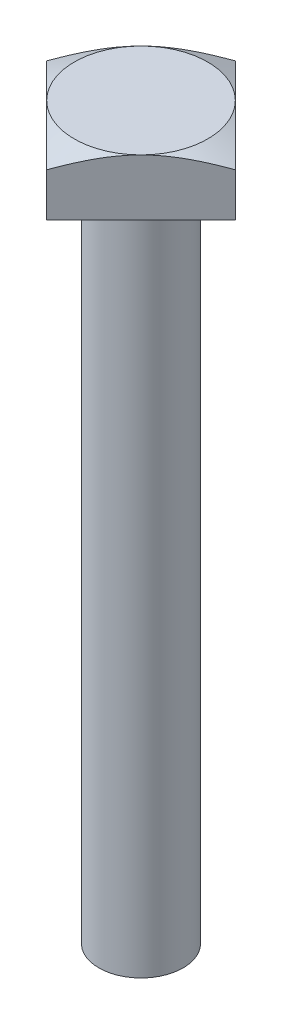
from build123d import *

# Parameters (mm, degrees)
SKETCH2_R           = 6
EXTRUDE2_DEPTH      = 8
SKETCH2_3_R         = 6
BOSS_EXTRUDE1_DEPTH = 96
SKETCH3_OUTSIDE_W   = 508.744
SKETCH3_OUTSIDE_H   = 508.744
SKETCH3_OUTSIDE_R   = 9.5
CUT_EXTRUDE1_DEPTH  = 106.721331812
CUT_EXTRUDE1_DRAFT  = -65


with BuildPart() as part:
    # Sketch2 → Extrude2 (new body)
    # profile 1 of 2: a face of its own
    with BuildSketch(Plane(origin=(0, 0, 0), x_dir=(1, 0, 0), z_dir=(0, 1, 0))):
        Polygon((-13.435028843, 0), (0, -13.435028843), (13.435028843, 0), (0, 13.435028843), align=None)
        Circle(SKETCH2_R, mode=Mode.SUBTRACT)
    # profile 2 of 2: a face of its own
    with BuildSketch(Plane(origin=(0, 0, 0), x_dir=(1, 0, 0), z_dir=(0, 1, 0))):
        Circle(SKETCH2_R)
    extrude(amount=EXTRUDE2_DEPTH)

    # Sketch2_3 → Boss-Extrude1 (add)
    with BuildSketch(Plane(origin=(0, 0, 0), x_dir=(1, 0, 0), z_dir=(0, 1, 0))):
        with Locations(Location((0, 0, 0), (0, 0, 270))):
            Circle(SKETCH2_3_R)
    extrude(amount=-BOSS_EXTRUDE1_DEPTH)


with BuildPart() as cut_extrude1_tool:
    # Sketch3 outside → Cut-Extrude1 (with draft: the straight prism first)
    with BuildSketch(Plane(origin=(0, 8, 0), x_dir=(1, 0, 0), z_dir=(0, 1, 0))):
        Rectangle(SKETCH3_OUTSIDE_W, SKETCH3_OUTSIDE_H)
        Circle(SKETCH3_OUTSIDE_R, mode=Mode.SUBTRACT)
    extrude(amount=-CUT_EXTRUDE1_DEPTH)
    # Cut-Extrude1: the draft: its side faces are tilted about the plane it starts from
    cut_extrude1_sides = [cut_extrude1_tool.faces().sort_by_distance(p)[0] for p in [
        (0, -45.360665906, 254.372),
        (254.372, -45.360665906, 0),
        (0, -45.360665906, -254.372),
        (-254.372, -45.360665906, 0),
        (-9.5, -45.360665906, 0),
    ]]
    draft(cut_extrude1_sides, Plane(origin=(0, 8, 0), x_dir=(1, 0, 0), z_dir=(0, 1, 0)), CUT_EXTRUDE1_DRAFT)


with BuildPart() as part_1:
    add(part.part)

    # Cut-Extrude1: cut by cut_extrude1_tool
    add(cut_extrude1_tool.part, mode=Mode.SUBTRACT)


solid = part_1.part
